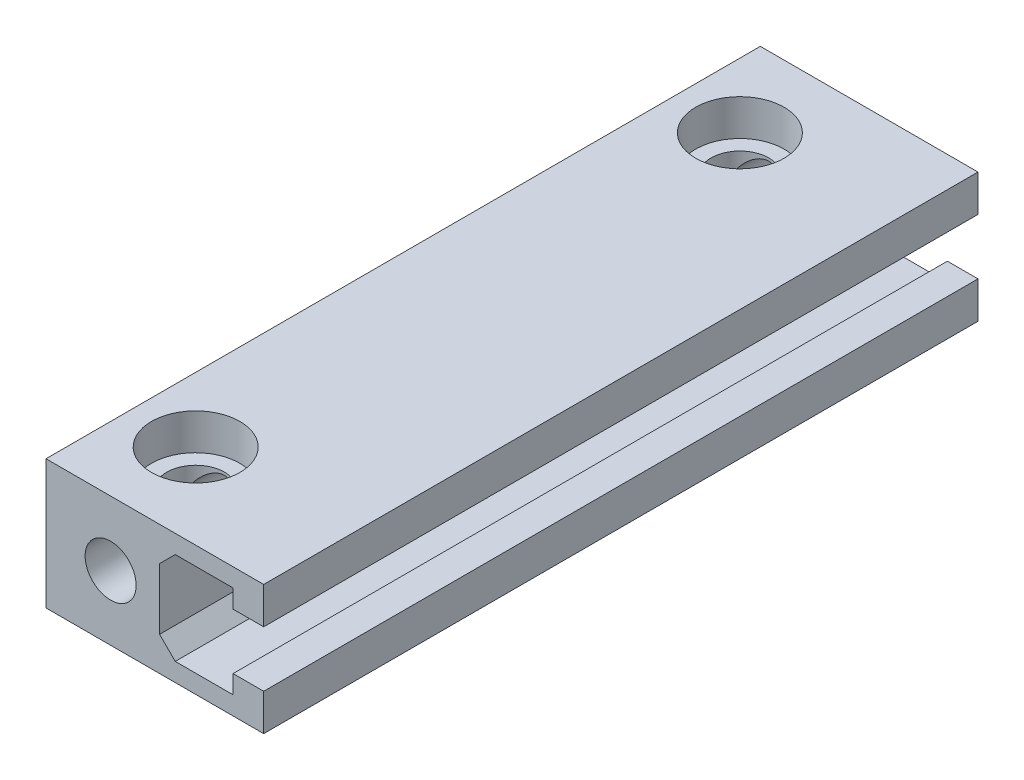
from build123d import *

# Parameters (mm, degrees)
EXTRUDE1_DEPTH                          = 52.5
EXTRUDE1_DEPTH_BACK                     = 52.5
SKETCH1_R                               = 3.75
CBORE_FOR_M8_HEX_HEAD_BOLT1_D           = 8.5
CBORE_FOR_M8_HEX_HEAD_BOLT1_CBORE_D     = 13
CBORE_FOR_M8_HEX_HEAD_BOLT1_CBORE_DEPTH = 5.33


with BuildPart() as part:
    # Sketch1 → Extrude1 (new, two sides: drawn at the far end of the back side and taken through both)
    with BuildSketch(Plane.XY.offset(-EXTRUDE1_DEPTH_BACK)):
        Polygon((-9.5, -9.5), (22.499999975, -9.5), (22.499999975, -4.1), (17.999999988, -4.1), (17.999999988, -6.8), (9.499999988, -6.8), (7.199999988, -4.5), (7.199999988, 4.5), (9.499999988, 6.8), (17.999999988, 6.8), (17.999999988, 4.1), (22.499999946, 4.1), (22.499999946, 9.499999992), (-9.5, 9.499999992), align=None)
        Circle(SKETCH1_R, mode=Mode.SUBTRACT)
    extrude(amount=EXTRUDE1_DEPTH + EXTRUDE1_DEPTH_BACK)

    # CBORE for M8 Hex Head Bolt1 (through all)
    with Locations(Plane(origin=(0, 9.499999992, -40), x_dir=(0, 0, 1), z_dir=(0, 1, 0))):
        with Locations((0, 0), (80, 0)):
            CounterBoreHole(CBORE_FOR_M8_HEX_HEAD_BOLT1_D / 2, CBORE_FOR_M8_HEX_HEAD_BOLT1_CBORE_D / 2, CBORE_FOR_M8_HEX_HEAD_BOLT1_CBORE_DEPTH)


solid = part.part
